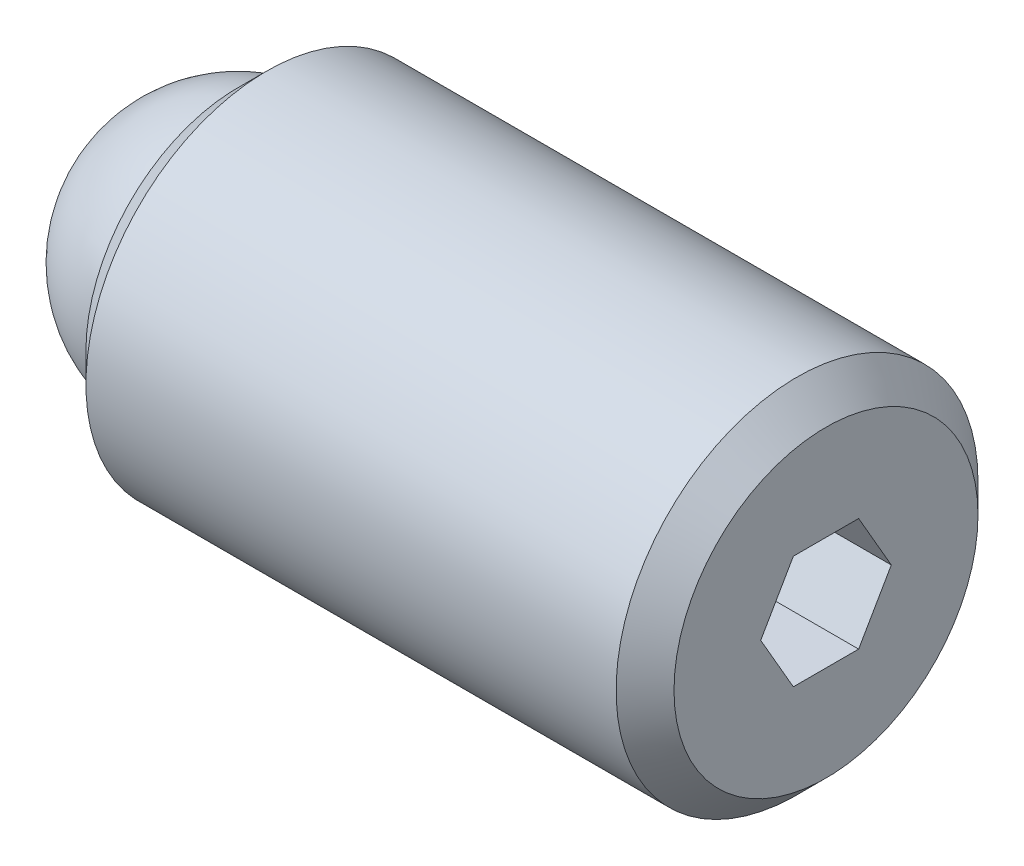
ISO-10303-21;
HEADER;
FILE_DESCRIPTION(('STEP AP214'),'2;1');
FILE_NAME('part.step','',(''),(''),'','','');
FILE_SCHEMA(('AUTOMOTIVE_DESIGN { 1 0 10303 214 1 1 1 1 }'));
ENDSEC;
DATA;
#1=APPLICATION_CONTEXT('core data for automotive mechanical design processes');
#2=APPLICATION_PROTOCOL_DEFINITION('international standard','automotive_design',2000,#1);
#3=PRODUCT_CONTEXT('',#1,'mechanical');
#4=PRODUCT('Part','Part','',(#3));
#5=PRODUCT_RELATED_PRODUCT_CATEGORY('part','',(#4));
#6=PRODUCT_DEFINITION_FORMATION('','',#4);
#7=PRODUCT_DEFINITION_CONTEXT('part definition',#1,'design');
#8=PRODUCT_DEFINITION('design','',#6,#7);
#9=PRODUCT_DEFINITION_SHAPE('','',#8);
#10=(LENGTH_UNIT() NAMED_UNIT(*) SI_UNIT(.MILLI.,.METRE.));
#11=(NAMED_UNIT(*) PLANE_ANGLE_UNIT() SI_UNIT($,.RADIAN.));
#12=(NAMED_UNIT(*) SI_UNIT($,.STERADIAN.) SOLID_ANGLE_UNIT());
#13=UNCERTAINTY_MEASURE_WITH_UNIT(LENGTH_MEASURE(1.E-05),#10,'distance_accuracy_value','');
#14=(GEOMETRIC_REPRESENTATION_CONTEXT(3) GLOBAL_UNCERTAINTY_ASSIGNED_CONTEXT((#13)) GLOBAL_UNIT_ASSIGNED_CONTEXT((#10,
#11,#12)) REPRESENTATION_CONTEXT('',''));
#15=CARTESIAN_POINT('',(0.,0.,0.));
#16=DIRECTION('',(0.,0.,1.));
#17=DIRECTION('',(1.,0.,0.));
#18=AXIS2_PLACEMENT_3D('',#15,#16,#17);
#19=CARTESIAN_POINT('',(0.,0.,0.));
#20=DIRECTION('',(0.,-1.,0.));
#21=DIRECTION('',(0.,0.,1.));
#22=AXIS2_PLACEMENT_3D('',#19,#20,#21);
#23=SPHERICAL_SURFACE('',#22,2.38125);
#24=CARTESIAN_POINT('',(0.,-2.38125,0.));
#25=VERTEX_POINT('',#24);
#26=VERTEX_LOOP('',#25);
#27=FACE_BOUND('',#26,.T.);
#28=ADVANCED_FACE('F41',(#27),#23,.T.);
#29=CLOSED_SHELL('',(#28));
#30=MANIFOLD_SOLID_BREP('B2',#29);
#31=CARTESIAN_POINT('',(10.31875,0.,0.));
#32=DIRECTION('',(-1.,0.,0.));
#33=DIRECTION('',(0.,0.,1.));
#34=AXIS2_PLACEMENT_3D('',#31,#32,#33);
#35=CYLINDRICAL_SURFACE('',#34,3.175);
#36=CARTESIAN_POINT('',(9.81075,0.,0.));
#37=DIRECTION('',(1.,0.,0.));
#38=DIRECTION('',(0.,0.,-1.));
#39=AXIS2_PLACEMENT_3D('',#36,#37,#38);
#40=CIRCLE('',#39,3.175);
#41=CARTESIAN_POINT('',(9.81075,0.,-3.175));
#42=VERTEX_POINT('',#41);
#43=EDGE_CURVE('E39',#42,#42,#40,.F.);
#44=ORIENTED_EDGE('',*,*,#43,.T.);
#45=EDGE_LOOP('',(#44));
#46=FACE_BOUND('',#45,.T.);
#47=CARTESIAN_POINT('',(0.508000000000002,0.,0.));
#48=DIRECTION('',(1.,0.,0.));
#49=DIRECTION('',(0.,0.,-1.));
#50=AXIS2_PLACEMENT_3D('',#47,#48,#49);
#51=CIRCLE('',#50,3.175);
#52=CARTESIAN_POINT('',(0.508000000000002,0.,-3.175));
#53=VERTEX_POINT('',#52);
#54=EDGE_CURVE('E176',#53,#53,#51,.T.);
#55=ORIENTED_EDGE('',*,*,#54,.T.);
#56=EDGE_LOOP('',(#55));
#57=FACE_BOUND('',#56,.T.);
#58=ADVANCED_FACE('F54',(#46,#57),#35,.T.);
#59=CARTESIAN_POINT('',(10.31875,0.,0.));
#60=DIRECTION('',(1.,0.,0.));
#61=DIRECTION('',(0.,0.,-1.));
#62=AXIS2_PLACEMENT_3D('',#59,#60,#61);
#63=PLANE('',#62);
#64=DIRECTION('',(0.,0.866025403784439,-0.5));
#65=VECTOR('',#64,1.);
#66=CARTESIAN_POINT('',(10.31875,-0.9921875,-0.572839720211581));
#67=LINE('',#66,#65);
#68=CARTESIAN_POINT('',(10.31875,-0.9921875,-0.572839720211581));
#69=VERTEX_POINT('',#68);
#70=CARTESIAN_POINT('',(10.31875,0.,-1.14567944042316));
#71=VERTEX_POINT('',#70);
#72=EDGE_CURVE('E77',#69,#71,#67,.T.);
#73=ORIENTED_EDGE('',*,*,#72,.F.);
#74=DIRECTION('',(0.,0.,-1.));
#75=VECTOR('',#74,1.);
#76=CARTESIAN_POINT('',(10.31875,-0.9921875,0.572839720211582));
#77=LINE('',#76,#75);
#78=CARTESIAN_POINT('',(10.31875,-0.9921875,0.572839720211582));
#79=VERTEX_POINT('',#78);
#80=EDGE_CURVE('E143',#79,#69,#77,.T.);
#81=ORIENTED_EDGE('',*,*,#80,.F.);
#82=DIRECTION('',(0.,-0.866025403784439,-0.5));
#83=VECTOR('',#82,1.);
#84=CARTESIAN_POINT('',(10.31875,0.,1.14567944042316));
#85=LINE('',#84,#83);
#86=CARTESIAN_POINT('',(10.31875,0.,1.14567944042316));
#87=VERTEX_POINT('',#86);
#88=EDGE_CURVE('E169',#87,#79,#85,.T.);
#89=ORIENTED_EDGE('',*,*,#88,.F.);
#90=DIRECTION('',(0.,-0.866025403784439,0.5));
#91=VECTOR('',#90,1.);
#92=CARTESIAN_POINT('',(10.31875,0.992187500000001,0.572839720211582));
#93=LINE('',#92,#91);
#94=CARTESIAN_POINT('',(10.31875,0.992187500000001,0.572839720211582));
#95=VERTEX_POINT('',#94);
#96=EDGE_CURVE('E166',#95,#87,#93,.T.);
#97=ORIENTED_EDGE('',*,*,#96,.F.);
#98=DIRECTION('',(0.,0.,1.));
#99=VECTOR('',#98,1.);
#100=CARTESIAN_POINT('',(10.31875,0.9921875,-0.572839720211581));
#101=LINE('',#100,#99);
#102=CARTESIAN_POINT('',(10.31875,0.9921875,-0.572839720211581));
#103=VERTEX_POINT('',#102);
#104=EDGE_CURVE('E163',#103,#95,#101,.T.);
#105=ORIENTED_EDGE('',*,*,#104,.F.);
#106=DIRECTION('',(0.,0.866025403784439,0.5));
#107=VECTOR('',#106,1.);
#108=CARTESIAN_POINT('',(10.31875,0.,-1.14567944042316));
#109=LINE('',#108,#107);
#110=EDGE_CURVE('E160',#71,#103,#109,.T.);
#111=ORIENTED_EDGE('',*,*,#110,.F.);
#112=EDGE_LOOP('',(#73,#81,#89,#97,#105,#111));
#113=FACE_BOUND('',#112,.T.);
#114=CARTESIAN_POINT('',(10.31875,0.,0.));
#115=DIRECTION('',(1.,0.,0.));
#116=DIRECTION('',(0.,0.,-1.));
#117=AXIS2_PLACEMENT_3D('',#114,#115,#116);
#118=CIRCLE('',#117,2.667);
#119=CARTESIAN_POINT('',(10.31875,0.,-2.667));
#120=VERTEX_POINT('',#119);
#121=EDGE_CURVE('E62',#120,#120,#118,.T.);
#122=ORIENTED_EDGE('',*,*,#121,.T.);
#123=EDGE_LOOP('',(#122));
#124=FACE_BOUND('',#123,.T.);
#125=ADVANCED_FACE('F193',(#113,#124),#63,.T.);
#126=CARTESIAN_POINT('',(0.,0.,0.));
#127=DIRECTION('',(1.,0.,0.));
#128=DIRECTION('',(0.,0.,-1.));
#129=AXIS2_PLACEMENT_3D('',#126,#127,#128);
#130=PLANE('',#129);
#131=CARTESIAN_POINT('',(0.,0.,0.));
#132=DIRECTION('',(-1.,0.,0.));
#133=DIRECTION('',(0.,0.,1.));
#134=AXIS2_PLACEMENT_3D('',#131,#132,#133);
#135=CIRCLE('',#134,2.38125);
#136=CARTESIAN_POINT('',(0.,2.38040333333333,-0.0634943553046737));
#137=VERTEX_POINT('',#136);
#138=CARTESIAN_POINT('',(0.,2.38040333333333,0.0634943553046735));
#139=VERTEX_POINT('',#138);
#140=EDGE_CURVE('E128',#137,#139,#135,.T.);
#141=ORIENTED_EDGE('',*,*,#140,.F.);
#142=CARTESIAN_POINT('',(0.,2.38125,0.));
#143=DIRECTION('',(-1.,0.,0.));
#144=DIRECTION('',(0.,0.,1.));
#145=AXIS2_PLACEMENT_3D('',#142,#143,#144);
#146=CIRCLE('',#145,0.0635000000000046);
#147=EDGE_CURVE('E117',#139,#137,#146,.T.);
#148=ORIENTED_EDGE('',*,*,#147,.F.);
#149=EDGE_LOOP('',(#141,#148));
#150=FACE_BOUND('',#149,.T.);
#151=CARTESIAN_POINT('',(0.,0.,0.));
#152=DIRECTION('',(1.,0.,0.));
#153=DIRECTION('',(0.,0.,-1.));
#154=AXIS2_PLACEMENT_3D('',#151,#152,#153);
#155=CIRCLE('',#154,2.667);
#156=CARTESIAN_POINT('',(0.,0.,-2.667));
#157=VERTEX_POINT('',#156);
#158=EDGE_CURVE('E188',#157,#157,#155,.F.);
#159=ORIENTED_EDGE('',*,*,#158,.T.);
#160=EDGE_LOOP('',(#159));
#161=FACE_BOUND('',#160,.T.);
#162=ADVANCED_FACE('F132',(#150,#161),#130,.F.);
#163=CARTESIAN_POINT('',(0.508000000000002,0.,0.));
#164=DIRECTION('',(1.,0.,0.));
#165=DIRECTION('',(0.,0.,-1.));
#166=AXIS2_PLACEMENT_3D('',#163,#164,#165);
#167=CONICAL_SURFACE('',#166,3.175,0.78539816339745);
#168=ORIENTED_EDGE('',*,*,#158,.F.);
#169=EDGE_LOOP('',(#168));
#170=FACE_BOUND('',#169,.T.);
#171=ORIENTED_EDGE('',*,*,#54,.F.);
#172=EDGE_LOOP('',(#171));
#173=FACE_BOUND('',#172,.T.);
#174=ADVANCED_FACE('F197',(#170,#173),#167,.T.);
#175=CARTESIAN_POINT('',(10.31875,0.,0.));
#176=DIRECTION('',(-1.,0.,0.));
#177=DIRECTION('',(0.,0.,1.));
#178=AXIS2_PLACEMENT_3D('',#175,#176,#177);
#179=CONICAL_SURFACE('',#178,2.667,0.785398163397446);
#180=ORIENTED_EDGE('',*,*,#43,.F.);
#181=EDGE_LOOP('',(#180));
#182=FACE_BOUND('',#181,.T.);
#183=ORIENTED_EDGE('',*,*,#121,.F.);
#184=EDGE_LOOP('',(#183));
#185=FACE_BOUND('',#184,.T.);
#186=ADVANCED_FACE('F56',(#182,#185),#179,.T.);
#187=CARTESIAN_POINT('',(8.03275,-0.9921875,-0.572839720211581));
#188=DIRECTION('',(0.,-0.5,-0.866025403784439));
#189=DIRECTION('',(0.,0.866025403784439,-0.5));
#190=AXIS2_PLACEMENT_3D('',#187,#188,#189);
#191=PLANE('',#190);
#192=ORIENTED_EDGE('',*,*,#72,.T.);
#193=DIRECTION('',(1.,0.,0.));
#194=VECTOR('',#193,1.);
#195=CARTESIAN_POINT('',(8.03275,0.,-1.14567944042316));
#196=LINE('',#195,#194);
#197=CARTESIAN_POINT('',(8.03275,0.,-1.14567944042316));
#198=VERTEX_POINT('',#197);
#199=EDGE_CURVE('E158',#198,#71,#196,.T.);
#200=ORIENTED_EDGE('',*,*,#199,.F.);
#201=DIRECTION('',(0.,0.866025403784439,-0.5));
#202=VECTOR('',#201,1.);
#203=CARTESIAN_POINT('',(8.03275,-0.9921875,-0.572839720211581));
#204=LINE('',#203,#202);
#205=CARTESIAN_POINT('',(8.03275,-0.9921875,-0.572839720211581));
#206=VERTEX_POINT('',#205);
#207=EDGE_CURVE('E139',#206,#198,#204,.T.);
#208=ORIENTED_EDGE('',*,*,#207,.F.);
#209=DIRECTION('',(1.,0.,0.));
#210=VECTOR('',#209,1.);
#211=CARTESIAN_POINT('',(8.03275,-0.9921875,-0.572839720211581));
#212=LINE('',#211,#210);
#213=EDGE_CURVE('E174',#206,#69,#212,.T.);
#214=ORIENTED_EDGE('',*,*,#213,.T.);
#215=EDGE_LOOP('',(#192,#200,#208,#214));
#216=FACE_BOUND('',#215,.T.);
#217=ADVANCED_FACE('F196',(#216),#191,.F.);
#218=CARTESIAN_POINT('',(8.03275,-0.9921875,0.572839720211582));
#219=DIRECTION('',(0.,-1.,0.));
#220=DIRECTION('',(0.,0.,-1.));
#221=AXIS2_PLACEMENT_3D('',#218,#219,#220);
#222=PLANE('',#221);
#223=ORIENTED_EDGE('',*,*,#80,.T.);
#224=ORIENTED_EDGE('',*,*,#213,.F.);
#225=DIRECTION('',(0.,0.,-1.));
#226=VECTOR('',#225,1.);
#227=CARTESIAN_POINT('',(8.03275,-0.9921875,0.572839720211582));
#228=LINE('',#227,#226);
#229=CARTESIAN_POINT('',(8.03275,-0.9921875,0.572839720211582));
#230=VERTEX_POINT('',#229);
#231=EDGE_CURVE('E155',#230,#206,#228,.T.);
#232=ORIENTED_EDGE('',*,*,#231,.F.);
#233=DIRECTION('',(1.,0.,0.));
#234=VECTOR('',#233,1.);
#235=CARTESIAN_POINT('',(8.03275,-0.9921875,0.572839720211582));
#236=LINE('',#235,#234);
#237=EDGE_CURVE('E177',#230,#79,#236,.T.);
#238=ORIENTED_EDGE('',*,*,#237,.T.);
#239=EDGE_LOOP('',(#223,#224,#232,#238));
#240=FACE_BOUND('',#239,.T.);
#241=ADVANCED_FACE('F203',(#240),#222,.F.);
#242=CARTESIAN_POINT('',(8.03275,0.,1.14567944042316));
#243=DIRECTION('',(0.,-0.5,0.866025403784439));
#244=DIRECTION('',(0.,-0.866025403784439,-0.5));
#245=AXIS2_PLACEMENT_3D('',#242,#243,#244);
#246=PLANE('',#245);
#247=ORIENTED_EDGE('',*,*,#88,.T.);
#248=ORIENTED_EDGE('',*,*,#237,.F.);
#249=DIRECTION('',(0.,-0.866025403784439,-0.5));
#250=VECTOR('',#249,1.);
#251=CARTESIAN_POINT('',(8.03275,0.,1.14567944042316));
#252=LINE('',#251,#250);
#253=CARTESIAN_POINT('',(8.03275,0.,1.14567944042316));
#254=VERTEX_POINT('',#253);
#255=EDGE_CURVE('E152',#254,#230,#252,.T.);
#256=ORIENTED_EDGE('',*,*,#255,.F.);
#257=DIRECTION('',(1.,0.,0.));
#258=VECTOR('',#257,1.);
#259=CARTESIAN_POINT('',(8.03275,0.,1.14567944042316));
#260=LINE('',#259,#258);
#261=EDGE_CURVE('E179',#254,#87,#260,.T.);
#262=ORIENTED_EDGE('',*,*,#261,.T.);
#263=EDGE_LOOP('',(#247,#248,#256,#262));
#264=FACE_BOUND('',#263,.T.);
#265=ADVANCED_FACE('F231',(#264),#246,.F.);
#266=CARTESIAN_POINT('',(8.03275,0.992187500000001,0.572839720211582));
#267=DIRECTION('',(0.,0.5,0.866025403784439));
#268=DIRECTION('',(0.,-0.866025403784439,0.5));
#269=AXIS2_PLACEMENT_3D('',#266,#267,#268);
#270=PLANE('',#269);
#271=ORIENTED_EDGE('',*,*,#96,.T.);
#272=ORIENTED_EDGE('',*,*,#261,.F.);
#273=DIRECTION('',(0.,-0.866025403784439,0.5));
#274=VECTOR('',#273,1.);
#275=CARTESIAN_POINT('',(8.03275,0.992187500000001,0.572839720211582));
#276=LINE('',#275,#274);
#277=CARTESIAN_POINT('',(8.03275,0.992187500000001,0.572839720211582));
#278=VERTEX_POINT('',#277);
#279=EDGE_CURVE('E149',#278,#254,#276,.T.);
#280=ORIENTED_EDGE('',*,*,#279,.F.);
#281=DIRECTION('',(1.,0.,0.));
#282=VECTOR('',#281,1.);
#283=CARTESIAN_POINT('',(8.03275,0.992187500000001,0.572839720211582));
#284=LINE('',#283,#282);
#285=EDGE_CURVE('E181',#278,#95,#284,.T.);
#286=ORIENTED_EDGE('',*,*,#285,.T.);
#287=EDGE_LOOP('',(#271,#272,#280,#286));
#288=FACE_BOUND('',#287,.T.);
#289=ADVANCED_FACE('F227',(#288),#270,.F.);
#290=CARTESIAN_POINT('',(8.03275,0.9921875,-0.572839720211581));
#291=DIRECTION('',(0.,1.,0.));
#292=DIRECTION('',(0.,0.,1.));
#293=AXIS2_PLACEMENT_3D('',#290,#291,#292);
#294=PLANE('',#293);
#295=ORIENTED_EDGE('',*,*,#104,.T.);
#296=ORIENTED_EDGE('',*,*,#285,.F.);
#297=DIRECTION('',(0.,0.,1.));
#298=VECTOR('',#297,1.);
#299=CARTESIAN_POINT('',(8.03275,0.9921875,-0.572839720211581));
#300=LINE('',#299,#298);
#301=CARTESIAN_POINT('',(8.03275,0.9921875,-0.572839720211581));
#302=VERTEX_POINT('',#301);
#303=EDGE_CURVE('E146',#302,#278,#300,.T.);
#304=ORIENTED_EDGE('',*,*,#303,.F.);
#305=DIRECTION('',(1.,0.,0.));
#306=VECTOR('',#305,1.);
#307=CARTESIAN_POINT('',(8.03275,0.9921875,-0.572839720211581));
#308=LINE('',#307,#306);
#309=EDGE_CURVE('E183',#302,#103,#308,.T.);
#310=ORIENTED_EDGE('',*,*,#309,.T.);
#311=EDGE_LOOP('',(#295,#296,#304,#310));
#312=FACE_BOUND('',#311,.T.);
#313=ADVANCED_FACE('F223',(#312),#294,.F.);
#314=CARTESIAN_POINT('',(8.03275,0.,-1.14567944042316));
#315=DIRECTION('',(0.,0.5,-0.866025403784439));
#316=DIRECTION('',(0.,0.866025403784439,0.5));
#317=AXIS2_PLACEMENT_3D('',#314,#315,#316);
#318=PLANE('',#317);
#319=ORIENTED_EDGE('',*,*,#110,.T.);
#320=ORIENTED_EDGE('',*,*,#309,.F.);
#321=DIRECTION('',(0.,0.866025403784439,0.5));
#322=VECTOR('',#321,1.);
#323=CARTESIAN_POINT('',(8.03275,0.,-1.14567944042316));
#324=LINE('',#323,#322);
#325=EDGE_CURVE('E142',#198,#302,#324,.T.);
#326=ORIENTED_EDGE('',*,*,#325,.F.);
#327=ORIENTED_EDGE('',*,*,#199,.T.);
#328=EDGE_LOOP('',(#319,#320,#326,#327));
#329=FACE_BOUND('',#328,.T.);
#330=ADVANCED_FACE('F219',(#329),#318,.F.);
#331=CARTESIAN_POINT('',(8.03275,0.,0.));
#332=DIRECTION('',(1.,0.,0.));
#333=DIRECTION('',(0.,0.,-1.));
#334=AXIS2_PLACEMENT_3D('',#331,#332,#333);
#335=PLANE('',#334);
#336=ORIENTED_EDGE('',*,*,#207,.T.);
#337=ORIENTED_EDGE('',*,*,#325,.T.);
#338=ORIENTED_EDGE('',*,*,#303,.T.);
#339=ORIENTED_EDGE('',*,*,#279,.T.);
#340=ORIENTED_EDGE('',*,*,#255,.T.);
#341=ORIENTED_EDGE('',*,*,#231,.T.);
#342=EDGE_LOOP('',(#336,#337,#338,#339,#340,#341));
#343=FACE_BOUND('',#342,.T.);
#344=ADVANCED_FACE('F222',(#343),#335,.T.);
#345=CARTESIAN_POINT('',(2.38125,0.,0.));
#346=DIRECTION('',(-1.,0.,0.));
#347=DIRECTION('',(0.,0.,1.));
#348=AXIS2_PLACEMENT_3D('',#345,#346,#347);
#349=CYLINDRICAL_SURFACE('',#348,2.38125);
#350=CARTESIAN_POINT('',(2.38125,0.,0.));
#351=DIRECTION('',(-1.,0.,0.));
#352=DIRECTION('',(0.,0.,1.));
#353=AXIS2_PLACEMENT_3D('',#350,#351,#352);
#354=CIRCLE('',#353,2.38125);
#355=CARTESIAN_POINT('',(2.38125,2.38040333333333,-0.0634943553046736));
#356=VERTEX_POINT('',#355);
#357=CARTESIAN_POINT('',(2.38125,2.38040333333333,0.0634943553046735));
#358=VERTEX_POINT('',#357);
#359=EDGE_CURVE('E130',#356,#358,#354,.T.);
#360=ORIENTED_EDGE('',*,*,#359,.F.);
#361=DIRECTION('',(-1.,0.,0.));
#362=VECTOR('',#361,1.);
#363=CARTESIAN_POINT('',(2.52362097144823,2.38040333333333,-0.0634943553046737));
#364=LINE('',#363,#362);
#365=EDGE_CURVE('E69',#356,#137,#364,.T.);
#366=ORIENTED_EDGE('',*,*,#365,.T.);
#367=ORIENTED_EDGE('',*,*,#140,.T.);
#368=DIRECTION('',(-1.,0.,0.));
#369=VECTOR('',#368,1.);
#370=CARTESIAN_POINT('',(2.52362097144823,2.38040333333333,0.0634943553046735));
#371=LINE('',#370,#369);
#372=EDGE_CURVE('E120',#358,#139,#371,.T.);
#373=ORIENTED_EDGE('',*,*,#372,.F.);
#374=EDGE_LOOP('',(#360,#366,#367,#373));
#375=FACE_BOUND('',#374,.T.);
#376=ADVANCED_FACE('F127',(#375),#349,.F.);
#377=CARTESIAN_POINT('',(2.38125,0.,0.));
#378=DIRECTION('',(-1.,0.,0.));
#379=DIRECTION('',(0.,0.,1.));
#380=AXIS2_PLACEMENT_3D('',#377,#378,#379);
#381=PLANE('',#380);
#382=ORIENTED_EDGE('',*,*,#359,.T.);
#383=CARTESIAN_POINT('',(2.38125,2.38125,0.));
#384=DIRECTION('',(-1.,0.,0.));
#385=DIRECTION('',(0.,0.,1.));
#386=AXIS2_PLACEMENT_3D('',#383,#384,#385);
#387=CIRCLE('',#386,0.0635000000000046);
#388=EDGE_CURVE('E134',#356,#358,#387,.F.);
#389=ORIENTED_EDGE('',*,*,#388,.F.);
#390=EDGE_LOOP('',(#382,#389));
#391=FACE_BOUND('',#390,.T.);
#392=ADVANCED_FACE('F244',(#391),#381,.T.);
#393=CARTESIAN_POINT('',(2.52362097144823,2.38125,0.));
#394=DIRECTION('',(-1.,0.,0.));
#395=DIRECTION('',(0.,0.,1.));
#396=AXIS2_PLACEMENT_3D('',#393,#394,#395);
#397=CYLINDRICAL_SURFACE('',#396,0.0635000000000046);
#398=ORIENTED_EDGE('',*,*,#388,.T.);
#399=ORIENTED_EDGE('',*,*,#372,.T.);
#400=ORIENTED_EDGE('',*,*,#147,.T.);
#401=ORIENTED_EDGE('',*,*,#365,.F.);
#402=EDGE_LOOP('',(#398,#399,#400,#401));
#403=FACE_BOUND('',#402,.T.);
#404=ADVANCED_FACE('F118',(#403),#397,.F.);
#405=CLOSED_SHELL('',(#58,#125,#162,#174,#186,#217,#241,#265,#289,#313,#330,#344,#376,#392,#404));
#406=MANIFOLD_SOLID_BREP('B6',#405);
#407=ADVANCED_BREP_SHAPE_REPRESENTATION('',(#18,#30,#406),#14);
#408=SHAPE_DEFINITION_REPRESENTATION(#9,#407);
ENDSEC;
END-ISO-10303-21;
